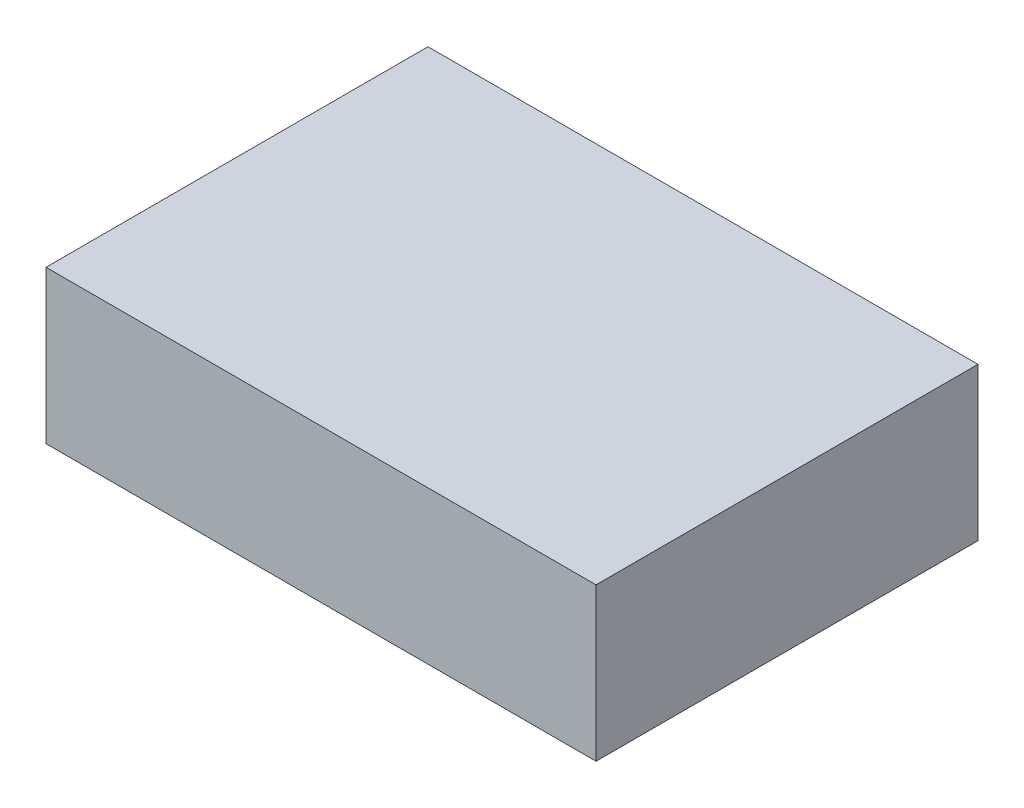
ISO-10303-21;
HEADER;
FILE_DESCRIPTION(('STEP AP214'),'2;1');
FILE_NAME('part.step','',(''),(''),'','','');
FILE_SCHEMA(('AUTOMOTIVE_DESIGN { 1 0 10303 214 1 1 1 1 }'));
ENDSEC;
DATA;
#1=APPLICATION_CONTEXT('core data for automotive mechanical design processes');
#2=APPLICATION_PROTOCOL_DEFINITION('international standard','automotive_design',2000,#1);
#3=PRODUCT_CONTEXT('',#1,'mechanical');
#4=PRODUCT('Part','Part','',(#3));
#5=PRODUCT_RELATED_PRODUCT_CATEGORY('part','',(#4));
#6=PRODUCT_DEFINITION_FORMATION('','',#4);
#7=PRODUCT_DEFINITION_CONTEXT('part definition',#1,'design');
#8=PRODUCT_DEFINITION('design','',#6,#7);
#9=PRODUCT_DEFINITION_SHAPE('','',#8);
#10=(LENGTH_UNIT() NAMED_UNIT(*) SI_UNIT(.MILLI.,.METRE.));
#11=(NAMED_UNIT(*) PLANE_ANGLE_UNIT() SI_UNIT($,.RADIAN.));
#12=(NAMED_UNIT(*) SI_UNIT($,.STERADIAN.) SOLID_ANGLE_UNIT());
#13=UNCERTAINTY_MEASURE_WITH_UNIT(LENGTH_MEASURE(1.E-05),#10,'distance_accuracy_value','');
#14=(GEOMETRIC_REPRESENTATION_CONTEXT(3) GLOBAL_UNCERTAINTY_ASSIGNED_CONTEXT((#13)) GLOBAL_UNIT_ASSIGNED_CONTEXT((#10,
#11,#12)) REPRESENTATION_CONTEXT('',''));
#15=CARTESIAN_POINT('',(0.,0.,0.));
#16=DIRECTION('',(0.,0.,1.));
#17=DIRECTION('',(1.,0.,0.));
#18=AXIS2_PLACEMENT_3D('',#15,#16,#17);
#19=CARTESIAN_POINT('',(18.,10.,-12.5));
#20=DIRECTION('',(-1.,0.,0.));
#21=DIRECTION('',(0.,0.,1.));
#22=AXIS2_PLACEMENT_3D('',#19,#20,#21);
#23=PLANE('',#22);
#24=DIRECTION('',(0.,0.,-1.));
#25=VECTOR('',#24,1.);
#26=CARTESIAN_POINT('',(18.,0.,-12.5));
#27=LINE('',#26,#25);
#28=CARTESIAN_POINT('',(18.,0.,12.5));
#29=VERTEX_POINT('',#28);
#30=CARTESIAN_POINT('',(18.,0.,-12.5));
#31=VERTEX_POINT('',#30);
#32=EDGE_CURVE('E96',#29,#31,#27,.T.);
#33=ORIENTED_EDGE('',*,*,#32,.T.);
#34=DIRECTION('',(0.,-1.,0.));
#35=VECTOR('',#34,1.);
#36=CARTESIAN_POINT('',(18.,10.,-12.5));
#37=LINE('',#36,#35);
#38=CARTESIAN_POINT('',(18.,10.,-12.5));
#39=VERTEX_POINT('',#38);
#40=EDGE_CURVE('E11',#39,#31,#37,.T.);
#41=ORIENTED_EDGE('',*,*,#40,.F.);
#42=DIRECTION('',(0.,0.,-1.));
#43=VECTOR('',#42,1.);
#44=CARTESIAN_POINT('',(18.,10.,-12.5));
#45=LINE('',#44,#43);
#46=CARTESIAN_POINT('',(18.,10.,12.5));
#47=VERTEX_POINT('',#46);
#48=EDGE_CURVE('E84',#47,#39,#45,.T.);
#49=ORIENTED_EDGE('',*,*,#48,.F.);
#50=DIRECTION('',(0.,-1.,0.));
#51=VECTOR('',#50,1.);
#52=CARTESIAN_POINT('',(18.,10.,12.5));
#53=LINE('',#52,#51);
#54=EDGE_CURVE('E92',#47,#29,#53,.T.);
#55=ORIENTED_EDGE('',*,*,#54,.T.);
#56=EDGE_LOOP('',(#33,#41,#49,#55));
#57=FACE_BOUND('',#56,.T.);
#58=ADVANCED_FACE('F33',(#57),#23,.F.);
#59=CARTESIAN_POINT('',(-18.,10.,-12.5));
#60=DIRECTION('',(0.,0.,1.));
#61=DIRECTION('',(1.,0.,0.));
#62=AXIS2_PLACEMENT_3D('',#59,#60,#61);
#63=PLANE('',#62);
#64=DIRECTION('',(-1.,0.,0.));
#65=VECTOR('',#64,1.);
#66=CARTESIAN_POINT('',(-18.,0.,-12.5));
#67=LINE('',#66,#65);
#68=CARTESIAN_POINT('',(-18.,0.,-12.5));
#69=VERTEX_POINT('',#68);
#70=EDGE_CURVE('E88',#31,#69,#67,.T.);
#71=ORIENTED_EDGE('',*,*,#70,.T.);
#72=DIRECTION('',(0.,-1.,0.));
#73=VECTOR('',#72,1.);
#74=CARTESIAN_POINT('',(-18.,10.,-12.5));
#75=LINE('',#74,#73);
#76=CARTESIAN_POINT('',(-18.,10.,-12.5));
#77=VERTEX_POINT('',#76);
#78=EDGE_CURVE('E41',#77,#69,#75,.T.);
#79=ORIENTED_EDGE('',*,*,#78,.F.);
#80=DIRECTION('',(-1.,0.,0.));
#81=VECTOR('',#80,1.);
#82=CARTESIAN_POINT('',(-18.,10.,-12.5));
#83=LINE('',#82,#81);
#84=EDGE_CURVE('E79',#39,#77,#83,.T.);
#85=ORIENTED_EDGE('',*,*,#84,.F.);
#86=ORIENTED_EDGE('',*,*,#40,.T.);
#87=EDGE_LOOP('',(#71,#79,#85,#86));
#88=FACE_BOUND('',#87,.T.);
#89=ADVANCED_FACE('F87',(#88),#63,.F.);
#90=CARTESIAN_POINT('',(-18.,10.,-12.5));
#91=DIRECTION('',(1.,0.,0.));
#92=DIRECTION('',(0.,0.,-1.));
#93=AXIS2_PLACEMENT_3D('',#90,#91,#92);
#94=PLANE('',#93);
#95=DIRECTION('',(0.,0.,1.));
#96=VECTOR('',#95,1.);
#97=CARTESIAN_POINT('',(-18.,0.,-12.5));
#98=LINE('',#97,#96);
#99=CARTESIAN_POINT('',(-18.,0.,12.5));
#100=VERTEX_POINT('',#99);
#101=EDGE_CURVE('E66',#69,#100,#98,.T.);
#102=ORIENTED_EDGE('',*,*,#101,.T.);
#103=DIRECTION('',(0.,-1.,0.));
#104=VECTOR('',#103,1.);
#105=CARTESIAN_POINT('',(-18.,10.,12.5));
#106=LINE('',#105,#104);
#107=CARTESIAN_POINT('',(-18.,10.,12.5));
#108=VERTEX_POINT('',#107);
#109=EDGE_CURVE('E89',#108,#100,#106,.T.);
#110=ORIENTED_EDGE('',*,*,#109,.F.);
#111=DIRECTION('',(0.,0.,1.));
#112=VECTOR('',#111,1.);
#113=CARTESIAN_POINT('',(-18.,10.,-12.5));
#114=LINE('',#113,#112);
#115=EDGE_CURVE('E82',#77,#108,#114,.T.);
#116=ORIENTED_EDGE('',*,*,#115,.F.);
#117=ORIENTED_EDGE('',*,*,#78,.T.);
#118=EDGE_LOOP('',(#102,#110,#116,#117));
#119=FACE_BOUND('',#118,.T.);
#120=ADVANCED_FACE('F90',(#119),#94,.F.);
#121=CARTESIAN_POINT('',(-18.,10.,12.5));
#122=DIRECTION('',(0.,0.,-1.));
#123=DIRECTION('',(-1.,0.,0.));
#124=AXIS2_PLACEMENT_3D('',#121,#122,#123);
#125=PLANE('',#124);
#126=DIRECTION('',(1.,0.,0.));
#127=VECTOR('',#126,1.);
#128=CARTESIAN_POINT('',(-18.,0.,12.5));
#129=LINE('',#128,#127);
#130=EDGE_CURVE('E72',#100,#29,#129,.T.);
#131=ORIENTED_EDGE('',*,*,#130,.T.);
#132=ORIENTED_EDGE('',*,*,#54,.F.);
#133=DIRECTION('',(1.,0.,0.));
#134=VECTOR('',#133,1.);
#135=CARTESIAN_POINT('',(-18.,10.,12.5));
#136=LINE('',#135,#134);
#137=EDGE_CURVE('E49',#108,#47,#136,.T.);
#138=ORIENTED_EDGE('',*,*,#137,.F.);
#139=ORIENTED_EDGE('',*,*,#109,.T.);
#140=EDGE_LOOP('',(#131,#132,#138,#139));
#141=FACE_BOUND('',#140,.T.);
#142=ADVANCED_FACE('F103',(#141),#125,.F.);
#143=CARTESIAN_POINT('',(18.,10.,12.5));
#144=DIRECTION('',(0.,1.,0.));
#145=DIRECTION('',(0.,0.,1.));
#146=AXIS2_PLACEMENT_3D('',#143,#144,#145);
#147=PLANE('',#146);
#148=ORIENTED_EDGE('',*,*,#48,.T.);
#149=ORIENTED_EDGE('',*,*,#84,.T.);
#150=ORIENTED_EDGE('',*,*,#115,.T.);
#151=ORIENTED_EDGE('',*,*,#137,.T.);
#152=EDGE_LOOP('',(#148,#149,#150,#151));
#153=FACE_BOUND('',#152,.T.);
#154=ADVANCED_FACE('F80',(#153),#147,.T.);
#155=CARTESIAN_POINT('',(18.,0.,12.5));
#156=DIRECTION('',(0.,1.,0.));
#157=DIRECTION('',(0.,0.,1.));
#158=AXIS2_PLACEMENT_3D('',#155,#156,#157);
#159=PLANE('',#158);
#160=ORIENTED_EDGE('',*,*,#32,.F.);
#161=ORIENTED_EDGE('',*,*,#130,.F.);
#162=ORIENTED_EDGE('',*,*,#101,.F.);
#163=ORIENTED_EDGE('',*,*,#70,.F.);
#164=EDGE_LOOP('',(#160,#161,#162,#163));
#165=FACE_BOUND('',#164,.T.);
#166=ADVANCED_FACE('F106',(#165),#159,.F.);
#167=CLOSED_SHELL('',(#58,#89,#120,#142,#154,#166));
#168=MANIFOLD_SOLID_BREP('B2',#167);
#169=ADVANCED_BREP_SHAPE_REPRESENTATION('',(#18,#168),#14);
#170=SHAPE_DEFINITION_REPRESENTATION(#9,#169);
ENDSEC;
END-ISO-10303-21;
